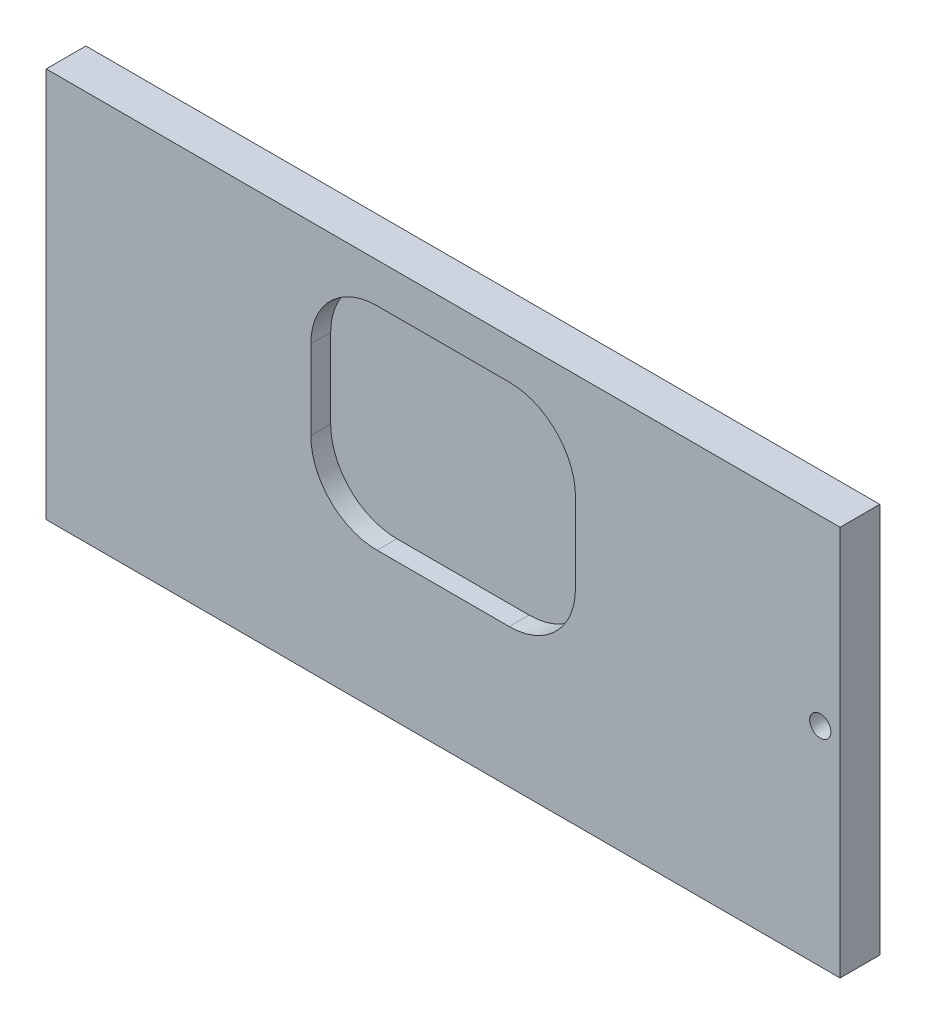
ISO-10303-21;
HEADER;
FILE_DESCRIPTION(('STEP AP214'),'2;1');
FILE_NAME('part.step','',(''),(''),'','','');
FILE_SCHEMA(('AUTOMOTIVE_DESIGN { 1 0 10303 214 1 1 1 1 }'));
ENDSEC;
DATA;
#1=APPLICATION_CONTEXT('core data for automotive mechanical design processes');
#2=APPLICATION_PROTOCOL_DEFINITION('international standard','automotive_design',2000,#1);
#3=PRODUCT_CONTEXT('',#1,'mechanical');
#4=PRODUCT('Part','Part','',(#3));
#5=PRODUCT_RELATED_PRODUCT_CATEGORY('part','',(#4));
#6=PRODUCT_DEFINITION_FORMATION('','',#4);
#7=PRODUCT_DEFINITION_CONTEXT('part definition',#1,'design');
#8=PRODUCT_DEFINITION('design','',#6,#7);
#9=PRODUCT_DEFINITION_SHAPE('','',#8);
#10=(LENGTH_UNIT() NAMED_UNIT(*) SI_UNIT(.MILLI.,.METRE.));
#11=(NAMED_UNIT(*) PLANE_ANGLE_UNIT() SI_UNIT($,.RADIAN.));
#12=(NAMED_UNIT(*) SI_UNIT($,.STERADIAN.) SOLID_ANGLE_UNIT());
#13=UNCERTAINTY_MEASURE_WITH_UNIT(LENGTH_MEASURE(1.E-05),#10,'distance_accuracy_value','');
#14=(GEOMETRIC_REPRESENTATION_CONTEXT(3) GLOBAL_UNCERTAINTY_ASSIGNED_CONTEXT((#13)) GLOBAL_UNIT_ASSIGNED_CONTEXT((#10,
#11,#12)) REPRESENTATION_CONTEXT('',''));
#15=CARTESIAN_POINT('',(0.,0.,0.));
#16=DIRECTION('',(0.,0.,1.));
#17=DIRECTION('',(1.,0.,0.));
#18=AXIS2_PLACEMENT_3D('',#15,#16,#17);
#19=CARTESIAN_POINT('',(-50.,30.,6.));
#20=DIRECTION('',(1.,0.,0.));
#21=DIRECTION('',(0.,1.,0.));
#22=AXIS2_PLACEMENT_3D('',#19,#20,#21);
#23=PLANE('',#22);
#24=DIRECTION('',(0.,-1.,0.));
#25=VECTOR('',#24,1.);
#26=CARTESIAN_POINT('',(-50.,30.,0.));
#27=LINE('',#26,#25);
#28=CARTESIAN_POINT('',(-50.,30.,0.));
#29=VERTEX_POINT('',#28);
#30=CARTESIAN_POINT('',(-50.,-29.,0.));
#31=VERTEX_POINT('',#30);
#32=EDGE_CURVE('E119',#29,#31,#27,.T.);
#33=ORIENTED_EDGE('',*,*,#32,.T.);
#34=DIRECTION('',(0.,0.,-1.));
#35=VECTOR('',#34,1.);
#36=CARTESIAN_POINT('',(-50.,-29.,6.));
#37=LINE('',#36,#35);
#38=CARTESIAN_POINT('',(-50.,-29.,6.));
#39=VERTEX_POINT('',#38);
#40=EDGE_CURVE('E126',#39,#31,#37,.T.);
#41=ORIENTED_EDGE('',*,*,#40,.F.);
#42=DIRECTION('',(0.,-1.,0.));
#43=VECTOR('',#42,1.);
#44=CARTESIAN_POINT('',(-50.,30.,6.));
#45=LINE('',#44,#43);
#46=CARTESIAN_POINT('',(-50.,30.,6.));
#47=VERTEX_POINT('',#46);
#48=EDGE_CURVE('E148',#47,#39,#45,.T.);
#49=ORIENTED_EDGE('',*,*,#48,.F.);
#50=DIRECTION('',(0.,0.,-1.));
#51=VECTOR('',#50,1.);
#52=CARTESIAN_POINT('',(-50.,30.,6.));
#53=LINE('',#52,#51);
#54=EDGE_CURVE('E137',#47,#29,#53,.T.);
#55=ORIENTED_EDGE('',*,*,#54,.T.);
#56=EDGE_LOOP('',(#33,#41,#49,#55));
#57=FACE_BOUND('',#56,.T.);
#58=ADVANCED_FACE('F27',(#57),#23,.F.);
#59=CARTESIAN_POINT('',(-50.,-29.,6.));
#60=DIRECTION('',(0.,1.,0.));
#61=DIRECTION('',(0.,0.,1.));
#62=AXIS2_PLACEMENT_3D('',#59,#60,#61);
#63=PLANE('',#62);
#64=DIRECTION('',(1.,0.,0.));
#65=VECTOR('',#64,1.);
#66=CARTESIAN_POINT('',(-50.,-29.,0.));
#67=LINE('',#66,#65);
#68=CARTESIAN_POINT('',(70.,-29.,0.));
#69=VERTEX_POINT('',#68);
#70=EDGE_CURVE('E114',#31,#69,#67,.T.);
#71=ORIENTED_EDGE('',*,*,#70,.T.);
#72=DIRECTION('',(0.,0.,-1.));
#73=VECTOR('',#72,1.);
#74=CARTESIAN_POINT('',(70.,-29.,6.));
#75=LINE('',#74,#73);
#76=CARTESIAN_POINT('',(70.,-29.,6.));
#77=VERTEX_POINT('',#76);
#78=EDGE_CURVE('E133',#77,#69,#75,.T.);
#79=ORIENTED_EDGE('',*,*,#78,.F.);
#80=DIRECTION('',(1.,0.,0.));
#81=VECTOR('',#80,1.);
#82=CARTESIAN_POINT('',(-50.,-29.,6.));
#83=LINE('',#82,#81);
#84=EDGE_CURVE('E128',#39,#77,#83,.T.);
#85=ORIENTED_EDGE('',*,*,#84,.F.);
#86=ORIENTED_EDGE('',*,*,#40,.T.);
#87=EDGE_LOOP('',(#71,#79,#85,#86));
#88=FACE_BOUND('',#87,.T.);
#89=ADVANCED_FACE('F127',(#88),#63,.F.);
#90=CARTESIAN_POINT('',(70.,30.,6.));
#91=DIRECTION('',(-1.,0.,0.));
#92=DIRECTION('',(0.,-1.,0.));
#93=AXIS2_PLACEMENT_3D('',#90,#91,#92);
#94=PLANE('',#93);
#95=DIRECTION('',(0.,1.,0.));
#96=VECTOR('',#95,1.);
#97=CARTESIAN_POINT('',(70.,30.,0.));
#98=LINE('',#97,#96);
#99=CARTESIAN_POINT('',(70.,30.,0.));
#100=VERTEX_POINT('',#99);
#101=EDGE_CURVE('E120',#69,#100,#98,.T.);
#102=ORIENTED_EDGE('',*,*,#101,.T.);
#103=DIRECTION('',(0.,0.,-1.));
#104=VECTOR('',#103,1.);
#105=CARTESIAN_POINT('',(70.,30.,6.));
#106=LINE('',#105,#104);
#107=CARTESIAN_POINT('',(70.,30.,6.));
#108=VERTEX_POINT('',#107);
#109=EDGE_CURVE('E156',#108,#100,#106,.T.);
#110=ORIENTED_EDGE('',*,*,#109,.F.);
#111=DIRECTION('',(0.,1.,0.));
#112=VECTOR('',#111,1.);
#113=CARTESIAN_POINT('',(70.,30.,6.));
#114=LINE('',#113,#112);
#115=EDGE_CURVE('E151',#77,#108,#114,.T.);
#116=ORIENTED_EDGE('',*,*,#115,.F.);
#117=ORIENTED_EDGE('',*,*,#78,.T.);
#118=EDGE_LOOP('',(#102,#110,#116,#117));
#119=FACE_BOUND('',#118,.T.);
#120=ADVANCED_FACE('F246',(#119),#94,.F.);
#121=CARTESIAN_POINT('',(-50.,30.,6.));
#122=DIRECTION('',(0.,-1.,0.));
#123=DIRECTION('',(0.,0.,-1.));
#124=AXIS2_PLACEMENT_3D('',#121,#122,#123);
#125=PLANE('',#124);
#126=DIRECTION('',(-1.,0.,0.));
#127=VECTOR('',#126,1.);
#128=CARTESIAN_POINT('',(-50.,30.,0.));
#129=LINE('',#128,#127);
#130=EDGE_CURVE('E146',#100,#29,#129,.T.);
#131=ORIENTED_EDGE('',*,*,#130,.T.);
#132=ORIENTED_EDGE('',*,*,#54,.F.);
#133=DIRECTION('',(-1.,0.,0.));
#134=VECTOR('',#133,1.);
#135=CARTESIAN_POINT('',(-50.,30.,6.));
#136=LINE('',#135,#134);
#137=EDGE_CURVE('E153',#108,#47,#136,.T.);
#138=ORIENTED_EDGE('',*,*,#137,.F.);
#139=ORIENTED_EDGE('',*,*,#109,.T.);
#140=EDGE_LOOP('',(#131,#132,#138,#139));
#141=FACE_BOUND('',#140,.T.);
#142=ADVANCED_FACE('F237',(#141),#125,.F.);
#143=CARTESIAN_POINT('',(-50.,30.,6.));
#144=DIRECTION('',(0.,0.,1.));
#145=DIRECTION('',(1.,0.,0.));
#146=AXIS2_PLACEMENT_3D('',#143,#144,#145);
#147=PLANE('',#146);
#148=CARTESIAN_POINT('',(67.,2.5,6.));
#149=DIRECTION('',(0.,0.,1.));
#150=DIRECTION('',(1.,0.,0.));
#151=AXIS2_PLACEMENT_3D('',#148,#149,#150);
#152=CIRCLE('',#151,1.60000000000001);
#153=CARTESIAN_POINT('',(68.6,2.5,6.));
#154=VERTEX_POINT('',#153);
#155=EDGE_CURVE('E230',#154,#154,#152,.T.);
#156=ORIENTED_EDGE('',*,*,#155,.F.);
#157=EDGE_LOOP('',(#156));
#158=FACE_BOUND('',#157,.T.);
#159=DIRECTION('',(0.,-1.,0.));
#160=VECTOR('',#159,1.);
#161=CARTESIAN_POINT('',(-10.,24.,6.));
#162=LINE('',#161,#160);
#163=CARTESIAN_POINT('',(-10.,14.,6.));
#164=VERTEX_POINT('',#163);
#165=CARTESIAN_POINT('',(-10.,2.,6.));
#166=VERTEX_POINT('',#165);
#167=EDGE_CURVE('E193',#164,#166,#162,.T.);
#168=ORIENTED_EDGE('',*,*,#167,.F.);
#169=CARTESIAN_POINT('',(0.,14.,6.));
#170=DIRECTION('',(0.,0.,1.));
#171=DIRECTION('',(1.,0.,0.));
#172=AXIS2_PLACEMENT_3D('',#169,#170,#171);
#173=CIRCLE('',#172,10.);
#174=CARTESIAN_POINT('',(0.,24.,6.));
#175=VERTEX_POINT('',#174);
#176=EDGE_CURVE('E34',#164,#175,#173,.F.);
#177=ORIENTED_EDGE('',*,*,#176,.T.);
#178=DIRECTION('',(-1.,0.,0.));
#179=VECTOR('',#178,1.);
#180=CARTESIAN_POINT('',(-10.,24.,6.));
#181=LINE('',#180,#179);
#182=CARTESIAN_POINT('',(20.,24.,6.));
#183=VERTEX_POINT('',#182);
#184=EDGE_CURVE('E220',#183,#175,#181,.T.);
#185=ORIENTED_EDGE('',*,*,#184,.F.);
#186=CARTESIAN_POINT('',(20.,14.,6.));
#187=DIRECTION('',(0.,0.,1.));
#188=DIRECTION('',(1.,0.,0.));
#189=AXIS2_PLACEMENT_3D('',#186,#187,#188);
#190=CIRCLE('',#189,10.);
#191=CARTESIAN_POINT('',(30.,14.,6.));
#192=VERTEX_POINT('',#191);
#193=EDGE_CURVE('E11',#183,#192,#190,.F.);
#194=ORIENTED_EDGE('',*,*,#193,.T.);
#195=DIRECTION('',(0.,1.,0.));
#196=VECTOR('',#195,1.);
#197=CARTESIAN_POINT('',(30.,24.,6.));
#198=LINE('',#197,#196);
#199=CARTESIAN_POINT('',(30.,2.,6.));
#200=VERTEX_POINT('',#199);
#201=EDGE_CURVE('E224',#200,#192,#198,.T.);
#202=ORIENTED_EDGE('',*,*,#201,.F.);
#203=CARTESIAN_POINT('',(20.,2.,6.));
#204=DIRECTION('',(0.,0.,1.));
#205=DIRECTION('',(1.,0.,0.));
#206=AXIS2_PLACEMENT_3D('',#203,#204,#205);
#207=CIRCLE('',#206,10.);
#208=CARTESIAN_POINT('',(20.,-8.,6.));
#209=VERTEX_POINT('',#208);
#210=EDGE_CURVE('E186',#200,#209,#207,.F.);
#211=ORIENTED_EDGE('',*,*,#210,.T.);
#212=DIRECTION('',(1.,0.,0.));
#213=VECTOR('',#212,1.);
#214=CARTESIAN_POINT('',(-10.,-8.,6.));
#215=LINE('',#214,#213);
#216=CARTESIAN_POINT('',(0.,-8.,6.));
#217=VERTEX_POINT('',#216);
#218=EDGE_CURVE('E195',#217,#209,#215,.T.);
#219=ORIENTED_EDGE('',*,*,#218,.F.);
#220=CARTESIAN_POINT('',(0.,2.,6.));
#221=DIRECTION('',(0.,0.,1.));
#222=DIRECTION('',(1.,0.,0.));
#223=AXIS2_PLACEMENT_3D('',#220,#221,#222);
#224=CIRCLE('',#223,10.);
#225=EDGE_CURVE('E188',#217,#166,#224,.F.);
#226=ORIENTED_EDGE('',*,*,#225,.T.);
#227=EDGE_LOOP('',(#168,#177,#185,#194,#202,#211,#219,#226));
#228=FACE_BOUND('',#227,.T.);
#229=ORIENTED_EDGE('',*,*,#48,.T.);
#230=ORIENTED_EDGE('',*,*,#84,.T.);
#231=ORIENTED_EDGE('',*,*,#115,.T.);
#232=ORIENTED_EDGE('',*,*,#137,.T.);
#233=EDGE_LOOP('',(#229,#230,#231,#232));
#234=FACE_BOUND('',#233,.T.);
#235=ADVANCED_FACE('F191',(#158,#228,#234),#147,.T.);
#236=CARTESIAN_POINT('',(-50.,30.,0.));
#237=DIRECTION('',(0.,0.,1.));
#238=DIRECTION('',(1.,0.,0.));
#239=AXIS2_PLACEMENT_3D('',#236,#237,#238);
#240=PLANE('',#239);
#241=CARTESIAN_POINT('',(67.,2.5,0.));
#242=DIRECTION('',(0.,0.,1.));
#243=DIRECTION('',(1.,0.,0.));
#244=AXIS2_PLACEMENT_3D('',#241,#242,#243);
#245=CIRCLE('',#244,1.60000000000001);
#246=CARTESIAN_POINT('',(68.6,2.5,0.));
#247=VERTEX_POINT('',#246);
#248=EDGE_CURVE('E204',#247,#247,#245,.T.);
#249=ORIENTED_EDGE('',*,*,#248,.T.);
#250=EDGE_LOOP('',(#249));
#251=FACE_BOUND('',#250,.T.);
#252=ORIENTED_EDGE('',*,*,#32,.F.);
#253=ORIENTED_EDGE('',*,*,#130,.F.);
#254=ORIENTED_EDGE('',*,*,#101,.F.);
#255=ORIENTED_EDGE('',*,*,#70,.F.);
#256=EDGE_LOOP('',(#252,#253,#254,#255));
#257=FACE_BOUND('',#256,.T.);
#258=ADVANCED_FACE('F116',(#251,#257),#240,.F.);
#259=CARTESIAN_POINT('',(-10.,24.,3.));
#260=DIRECTION('',(-1.,0.,0.));
#261=DIRECTION('',(0.,-1.,0.));
#262=AXIS2_PLACEMENT_3D('',#259,#260,#261);
#263=PLANE('',#262);
#264=ORIENTED_EDGE('',*,*,#167,.T.);
#265=DIRECTION('',(0.,0.,1.));
#266=VECTOR('',#265,1.);
#267=CARTESIAN_POINT('',(-10.,2.,3.));
#268=LINE('',#267,#266);
#269=CARTESIAN_POINT('',(-10.,2.,3.));
#270=VERTEX_POINT('',#269);
#271=EDGE_CURVE('E180',#166,#270,#268,.F.);
#272=ORIENTED_EDGE('',*,*,#271,.T.);
#273=DIRECTION('',(0.,-1.,0.));
#274=VECTOR('',#273,1.);
#275=CARTESIAN_POINT('',(-10.,24.,3.));
#276=LINE('',#275,#274);
#277=CARTESIAN_POINT('',(-10.,14.,3.));
#278=VERTEX_POINT('',#277);
#279=EDGE_CURVE('E214',#278,#270,#276,.T.);
#280=ORIENTED_EDGE('',*,*,#279,.F.);
#281=DIRECTION('',(0.,0.,1.));
#282=VECTOR('',#281,1.);
#283=CARTESIAN_POINT('',(-10.,14.,6.));
#284=LINE('',#283,#282);
#285=EDGE_CURVE('E177',#278,#164,#284,.T.);
#286=ORIENTED_EDGE('',*,*,#285,.T.);
#287=EDGE_LOOP('',(#264,#272,#280,#286));
#288=FACE_BOUND('',#287,.T.);
#289=ADVANCED_FACE('F200',(#288),#263,.F.);
#290=CARTESIAN_POINT('',(-10.,24.,3.));
#291=DIRECTION('',(0.,1.,0.));
#292=DIRECTION('',(0.,0.,1.));
#293=AXIS2_PLACEMENT_3D('',#290,#291,#292);
#294=PLANE('',#293);
#295=ORIENTED_EDGE('',*,*,#184,.T.);
#296=DIRECTION('',(0.,0.,1.));
#297=VECTOR('',#296,1.);
#298=CARTESIAN_POINT('',(0.,24.,3.));
#299=LINE('',#298,#297);
#300=CARTESIAN_POINT('',(0.,24.,3.));
#301=VERTEX_POINT('',#300);
#302=EDGE_CURVE('E184',#175,#301,#299,.F.);
#303=ORIENTED_EDGE('',*,*,#302,.T.);
#304=DIRECTION('',(-1.,0.,0.));
#305=VECTOR('',#304,1.);
#306=CARTESIAN_POINT('',(-10.,24.,3.));
#307=LINE('',#306,#305);
#308=CARTESIAN_POINT('',(20.,24.,3.));
#309=VERTEX_POINT('',#308);
#310=EDGE_CURVE('E138',#309,#301,#307,.T.);
#311=ORIENTED_EDGE('',*,*,#310,.F.);
#312=DIRECTION('',(0.,0.,1.));
#313=VECTOR('',#312,1.);
#314=CARTESIAN_POINT('',(20.,24.,6.));
#315=LINE('',#314,#313);
#316=EDGE_CURVE('E182',#309,#183,#315,.T.);
#317=ORIENTED_EDGE('',*,*,#316,.T.);
#318=EDGE_LOOP('',(#295,#303,#311,#317));
#319=FACE_BOUND('',#318,.T.);
#320=ADVANCED_FACE('F273',(#319),#294,.F.);
#321=CARTESIAN_POINT('',(30.,24.,3.));
#322=DIRECTION('',(1.,0.,0.));
#323=DIRECTION('',(0.,1.,0.));
#324=AXIS2_PLACEMENT_3D('',#321,#322,#323);
#325=PLANE('',#324);
#326=DIRECTION('',(0.,1.,0.));
#327=VECTOR('',#326,1.);
#328=CARTESIAN_POINT('',(30.,24.,3.));
#329=LINE('',#328,#327);
#330=CARTESIAN_POINT('',(30.,2.,3.));
#331=VERTEX_POINT('',#330);
#332=CARTESIAN_POINT('',(30.,14.,3.));
#333=VERTEX_POINT('',#332);
#334=EDGE_CURVE('E141',#331,#333,#329,.T.);
#335=ORIENTED_EDGE('',*,*,#334,.F.);
#336=DIRECTION('',(0.,0.,1.));
#337=VECTOR('',#336,1.);
#338=CARTESIAN_POINT('',(30.,2.,6.));
#339=LINE('',#338,#337);
#340=EDGE_CURVE('E161',#331,#200,#339,.T.);
#341=ORIENTED_EDGE('',*,*,#340,.T.);
#342=ORIENTED_EDGE('',*,*,#201,.T.);
#343=DIRECTION('',(0.,0.,1.));
#344=VECTOR('',#343,1.);
#345=CARTESIAN_POINT('',(30.,14.,3.));
#346=LINE('',#345,#344);
#347=EDGE_CURVE('E132',#192,#333,#346,.F.);
#348=ORIENTED_EDGE('',*,*,#347,.T.);
#349=EDGE_LOOP('',(#335,#341,#342,#348));
#350=FACE_BOUND('',#349,.T.);
#351=ADVANCED_FACE('F281',(#350),#325,.F.);
#352=CARTESIAN_POINT('',(-10.,-8.,3.));
#353=DIRECTION('',(0.,-1.,0.));
#354=DIRECTION('',(0.,0.,-1.));
#355=AXIS2_PLACEMENT_3D('',#352,#353,#354);
#356=PLANE('',#355);
#357=ORIENTED_EDGE('',*,*,#218,.T.);
#358=DIRECTION('',(0.,0.,1.));
#359=VECTOR('',#358,1.);
#360=CARTESIAN_POINT('',(20.,-8.,3.));
#361=LINE('',#360,#359);
#362=CARTESIAN_POINT('',(20.,-8.,3.));
#363=VERTEX_POINT('',#362);
#364=EDGE_CURVE('E167',#209,#363,#361,.F.);
#365=ORIENTED_EDGE('',*,*,#364,.T.);
#366=DIRECTION('',(1.,0.,0.));
#367=VECTOR('',#366,1.);
#368=CARTESIAN_POINT('',(-10.,-8.,3.));
#369=LINE('',#368,#367);
#370=CARTESIAN_POINT('',(0.,-8.,3.));
#371=VERTEX_POINT('',#370);
#372=EDGE_CURVE('E212',#371,#363,#369,.T.);
#373=ORIENTED_EDGE('',*,*,#372,.F.);
#374=DIRECTION('',(0.,0.,1.));
#375=VECTOR('',#374,1.);
#376=CARTESIAN_POINT('',(0.,-8.,6.));
#377=LINE('',#376,#375);
#378=EDGE_CURVE('E164',#371,#217,#377,.T.);
#379=ORIENTED_EDGE('',*,*,#378,.T.);
#380=EDGE_LOOP('',(#357,#365,#373,#379));
#381=FACE_BOUND('',#380,.T.);
#382=ADVANCED_FACE('F216',(#381),#356,.F.);
#383=CARTESIAN_POINT('',(-10.,-8.,3.));
#384=DIRECTION('',(0.,0.,1.));
#385=DIRECTION('',(1.,0.,0.));
#386=AXIS2_PLACEMENT_3D('',#383,#384,#385);
#387=PLANE('',#386);
#388=ORIENTED_EDGE('',*,*,#372,.T.);
#389=CARTESIAN_POINT('',(20.,2.,3.));
#390=DIRECTION('',(0.,0.,1.));
#391=DIRECTION('',(1.,0.,0.));
#392=AXIS2_PLACEMENT_3D('',#389,#390,#391);
#393=CIRCLE('',#392,10.);
#394=EDGE_CURVE('E175',#363,#331,#393,.T.);
#395=ORIENTED_EDGE('',*,*,#394,.T.);
#396=ORIENTED_EDGE('',*,*,#334,.T.);
#397=CARTESIAN_POINT('',(20.,14.,3.));
#398=DIRECTION('',(0.,0.,1.));
#399=DIRECTION('',(1.,0.,0.));
#400=AXIS2_PLACEMENT_3D('',#397,#398,#399);
#401=CIRCLE('',#400,10.);
#402=EDGE_CURVE('E169',#333,#309,#401,.T.);
#403=ORIENTED_EDGE('',*,*,#402,.T.);
#404=ORIENTED_EDGE('',*,*,#310,.T.);
#405=CARTESIAN_POINT('',(0.,14.,3.));
#406=DIRECTION('',(0.,0.,1.));
#407=DIRECTION('',(1.,0.,0.));
#408=AXIS2_PLACEMENT_3D('',#405,#406,#407);
#409=CIRCLE('',#408,10.);
#410=EDGE_CURVE('E171',#301,#278,#409,.T.);
#411=ORIENTED_EDGE('',*,*,#410,.T.);
#412=ORIENTED_EDGE('',*,*,#279,.T.);
#413=CARTESIAN_POINT('',(0.,2.,3.));
#414=DIRECTION('',(0.,0.,1.));
#415=DIRECTION('',(1.,0.,0.));
#416=AXIS2_PLACEMENT_3D('',#413,#414,#415);
#417=CIRCLE('',#416,10.);
#418=EDGE_CURVE('E173',#270,#371,#417,.T.);
#419=ORIENTED_EDGE('',*,*,#418,.T.);
#420=EDGE_LOOP('',(#388,#395,#396,#403,#404,#411,#412,#419));
#421=FACE_BOUND('',#420,.T.);
#422=ADVANCED_FACE('F211',(#421),#387,.T.);
#423=CARTESIAN_POINT('',(20.,2.,3.));
#424=DIRECTION('',(0.,0.,-1.));
#425=DIRECTION('',(-1.,0.,0.));
#426=AXIS2_PLACEMENT_3D('',#423,#424,#425);
#427=CYLINDRICAL_SURFACE('',#426,10.);
#428=ORIENTED_EDGE('',*,*,#394,.F.);
#429=ORIENTED_EDGE('',*,*,#364,.F.);
#430=ORIENTED_EDGE('',*,*,#210,.F.);
#431=ORIENTED_EDGE('',*,*,#340,.F.);
#432=EDGE_LOOP('',(#428,#429,#430,#431));
#433=FACE_BOUND('',#432,.T.);
#434=ADVANCED_FACE('F302',(#433),#427,.F.);
#435=CARTESIAN_POINT('',(0.,2.,3.));
#436=DIRECTION('',(0.,0.,-1.));
#437=DIRECTION('',(-1.,0.,0.));
#438=AXIS2_PLACEMENT_3D('',#435,#436,#437);
#439=CYLINDRICAL_SURFACE('',#438,10.);
#440=ORIENTED_EDGE('',*,*,#418,.F.);
#441=ORIENTED_EDGE('',*,*,#271,.F.);
#442=ORIENTED_EDGE('',*,*,#225,.F.);
#443=ORIENTED_EDGE('',*,*,#378,.F.);
#444=EDGE_LOOP('',(#440,#441,#442,#443));
#445=FACE_BOUND('',#444,.T.);
#446=ADVANCED_FACE('F207',(#445),#439,.F.);
#447=CARTESIAN_POINT('',(0.,14.,3.));
#448=DIRECTION('',(0.,0.,-1.));
#449=DIRECTION('',(-1.,0.,0.));
#450=AXIS2_PLACEMENT_3D('',#447,#448,#449);
#451=CYLINDRICAL_SURFACE('',#450,10.);
#452=ORIENTED_EDGE('',*,*,#410,.F.);
#453=ORIENTED_EDGE('',*,*,#302,.F.);
#454=ORIENTED_EDGE('',*,*,#176,.F.);
#455=ORIENTED_EDGE('',*,*,#285,.F.);
#456=EDGE_LOOP('',(#452,#453,#454,#455));
#457=FACE_BOUND('',#456,.T.);
#458=ADVANCED_FACE('F316',(#457),#451,.F.);
#459=CARTESIAN_POINT('',(20.,14.,3.));
#460=DIRECTION('',(0.,0.,-1.));
#461=DIRECTION('',(-1.,0.,0.));
#462=AXIS2_PLACEMENT_3D('',#459,#460,#461);
#463=CYLINDRICAL_SURFACE('',#462,10.);
#464=ORIENTED_EDGE('',*,*,#402,.F.);
#465=ORIENTED_EDGE('',*,*,#347,.F.);
#466=ORIENTED_EDGE('',*,*,#193,.F.);
#467=ORIENTED_EDGE('',*,*,#316,.F.);
#468=EDGE_LOOP('',(#464,#465,#466,#467));
#469=FACE_BOUND('',#468,.T.);
#470=ADVANCED_FACE('F322',(#469),#463,.F.);
#471=CARTESIAN_POINT('',(67.,2.5,0.));
#472=DIRECTION('',(0.,0.,1.));
#473=DIRECTION('',(1.,0.,0.));
#474=AXIS2_PLACEMENT_3D('',#471,#472,#473);
#475=CYLINDRICAL_SURFACE('',#474,1.60000000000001);
#476=ORIENTED_EDGE('',*,*,#248,.F.);
#477=EDGE_LOOP('',(#476));
#478=FACE_BOUND('',#477,.T.);
#479=ORIENTED_EDGE('',*,*,#155,.T.);
#480=EDGE_LOOP('',(#479));
#481=FACE_BOUND('',#480,.T.);
#482=ADVANCED_FACE('F234',(#478,#481),#475,.F.);
#483=CLOSED_SHELL('',(#58,#89,#120,#142,#235,#258,#289,#320,#351,#382,#422,#434,#446,#458,#470,#482));
#484=MANIFOLD_SOLID_BREP('B2',#483);
#485=ADVANCED_BREP_SHAPE_REPRESENTATION('',(#18,#484),#14);
#486=SHAPE_DEFINITION_REPRESENTATION(#9,#485);
ENDSEC;
END-ISO-10303-21;
